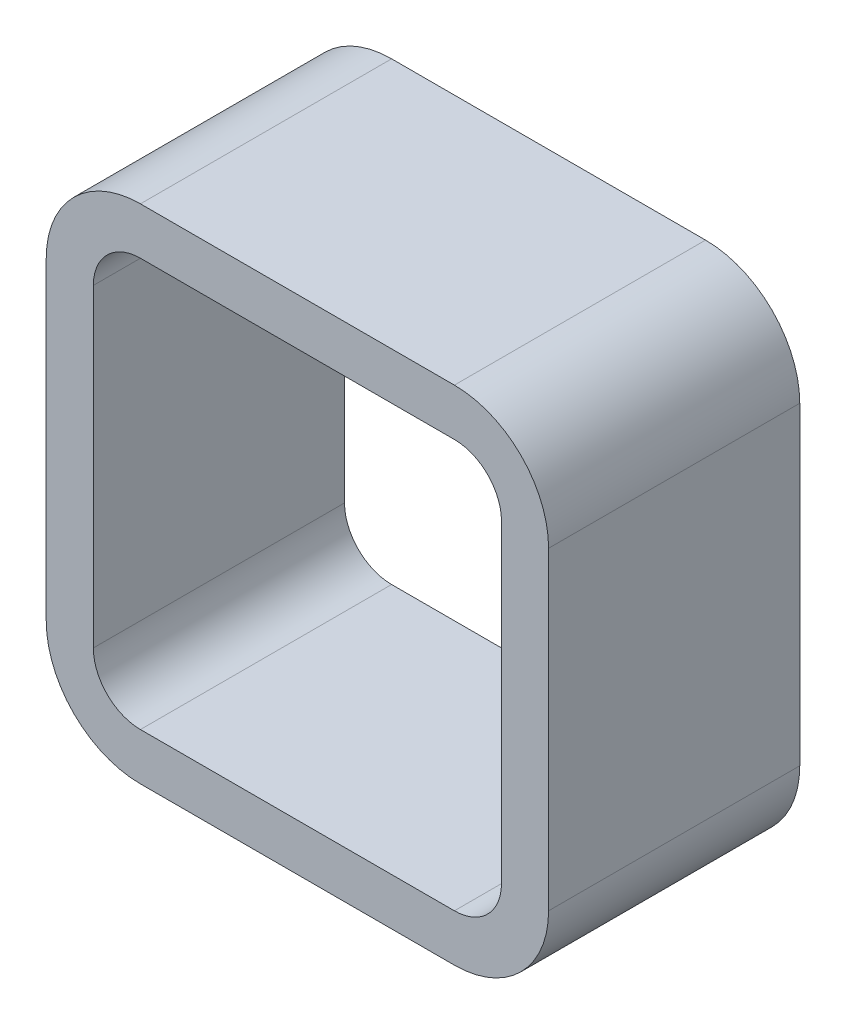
from build123d import *

# Parameters (mm, degrees)
BASETUBES_DEPTH = 12.7


with BuildPart() as part:
    # Sketch1 → BaseTubeS (new, symmetric)
    with BuildSketch(Plane.XY):
        with BuildLine():
            Line((9.52499175, 0), (41.27496425, 0))
            ThreePointArc((41.27496425, 0), (48.010150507, 2.789805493), (50.799956, 9.52499175))
            Line((50.799956, 9.52499175), (50.799956, 41.27496425))
            ThreePointArc((50.799956, 41.27496425), (48.010150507, 48.010150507), (41.27496425, 50.799956))
            Line((41.27496425, 50.799956), (9.52499175, 50.799956))
            ThreePointArc((9.52499175, 50.799956), (2.789805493, 48.010150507), (0, 41.27496425))
            Line((0, 41.27496425), (0, 9.52499175))
            ThreePointArc((0, 9.52499175), (2.789805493, 2.789805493), (9.52499175, 0))
        make_face()
        with BuildLine():
            Line((9.52499175, 4.762495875), (41.27496425, 4.762495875))
            ThreePointArc((41.27496425, 4.762495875), (44.642557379, 6.157398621), (46.037460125, 9.52499175))
            Line((46.037460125, 9.52499175), (46.037460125, 41.27496425))
            ThreePointArc((46.037460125, 41.27496425), (44.642557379, 44.642557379), (41.27496425, 46.037460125))
            Line((41.27496425, 46.037460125), (9.52499175, 46.037460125))
            ThreePointArc((9.52499175, 46.037460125), (6.157398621, 44.642557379), (4.762495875, 41.27496425))
            Line((4.762495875, 41.27496425), (4.762495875, 9.52499175))
            ThreePointArc((4.762495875, 9.52499175), (6.157398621, 6.157398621), (9.52499175, 4.762495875))
        make_face(mode=Mode.SUBTRACT)
    extrude(amount=BASETUBES_DEPTH, both=True)


solid = part.part
